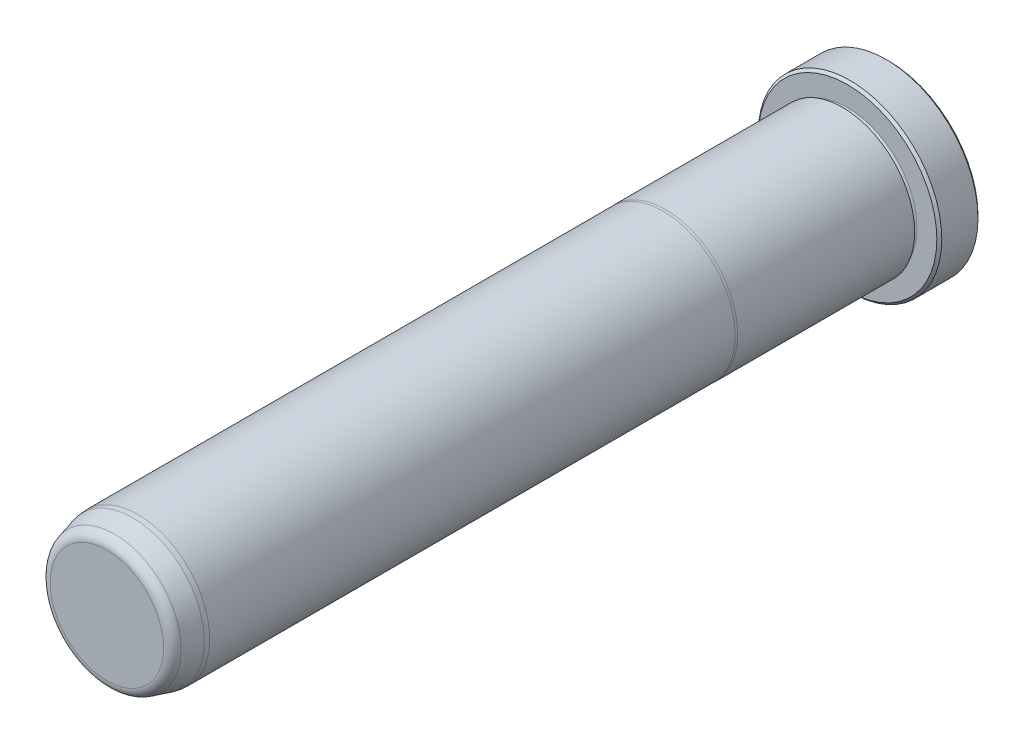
ISO-10303-21;
HEADER;
FILE_DESCRIPTION(('STEP AP214'),'2;1');
FILE_NAME('part.step','',(''),(''),'','','');
FILE_SCHEMA(('AUTOMOTIVE_DESIGN { 1 0 10303 214 1 1 1 1 }'));
ENDSEC;
DATA;
#1=APPLICATION_CONTEXT('core data for automotive mechanical design processes');
#2=APPLICATION_PROTOCOL_DEFINITION('international standard','automotive_design',2000,#1);
#3=PRODUCT_CONTEXT('',#1,'mechanical');
#4=PRODUCT('Part','Part','',(#3));
#5=PRODUCT_RELATED_PRODUCT_CATEGORY('part','',(#4));
#6=PRODUCT_DEFINITION_FORMATION('','',#4);
#7=PRODUCT_DEFINITION_CONTEXT('part definition',#1,'design');
#8=PRODUCT_DEFINITION('design','',#6,#7);
#9=PRODUCT_DEFINITION_SHAPE('','',#8);
#10=(LENGTH_UNIT() NAMED_UNIT(*) SI_UNIT(.MILLI.,.METRE.));
#11=(NAMED_UNIT(*) PLANE_ANGLE_UNIT() SI_UNIT($,.RADIAN.));
#12=(NAMED_UNIT(*) SI_UNIT($,.STERADIAN.) SOLID_ANGLE_UNIT());
#13=UNCERTAINTY_MEASURE_WITH_UNIT(LENGTH_MEASURE(1.E-05),#10,'distance_accuracy_value','');
#14=(GEOMETRIC_REPRESENTATION_CONTEXT(3) GLOBAL_UNCERTAINTY_ASSIGNED_CONTEXT((#13)) GLOBAL_UNIT_ASSIGNED_CONTEXT((#10,
#11,#12)) REPRESENTATION_CONTEXT('',''));
#15=CARTESIAN_POINT('',(0.,0.,0.));
#16=DIRECTION('',(0.,0.,1.));
#17=DIRECTION('',(1.,0.,0.));
#18=AXIS2_PLACEMENT_3D('',#15,#16,#17);
#19=CARTESIAN_POINT('',(0.,0.,0.));
#20=DIRECTION('',(0.,0.,1.));
#21=DIRECTION('',(1.,0.,0.));
#22=AXIS2_PLACEMENT_3D('',#19,#20,#21);
#23=PLANE('',#22);
#24=CARTESIAN_POINT('',(0.,0.,0.));
#25=DIRECTION('',(0.,0.,1.));
#26=DIRECTION('',(1.,0.,0.));
#27=AXIS2_PLACEMENT_3D('',#24,#25,#26);
#28=CIRCLE('',#27,13.7795);
#29=CARTESIAN_POINT('',(13.7795,0.,0.));
#30=VERTEX_POINT('',#29);
#31=EDGE_CURVE('E37',#30,#30,#28,.F.);
#32=ORIENTED_EDGE('',*,*,#31,.T.);
#33=EDGE_LOOP('',(#32));
#34=FACE_BOUND('',#33,.T.);
#35=ADVANCED_FACE('F30',(#34),#23,.F.);
#36=CARTESIAN_POINT('',(0.,0.,0.));
#37=DIRECTION('',(0.,0.,1.));
#38=DIRECTION('',(1.,0.,0.));
#39=AXIS2_PLACEMENT_3D('',#36,#37,#38);
#40=CYLINDRICAL_SURFACE('',#39,14.1605);
#41=CARTESIAN_POINT('',(0.,0.,0.380999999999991));
#42=DIRECTION('',(0.,0.,1.));
#43=DIRECTION('',(1.,0.,0.));
#44=AXIS2_PLACEMENT_3D('',#41,#42,#43);
#45=CIRCLE('',#44,14.1605);
#46=CARTESIAN_POINT('',(14.1605,0.,0.380999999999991));
#47=VERTEX_POINT('',#46);
#48=EDGE_CURVE('E41',#47,#47,#45,.T.);
#49=ORIENTED_EDGE('',*,*,#48,.T.);
#50=EDGE_LOOP('',(#49));
#51=FACE_BOUND('',#50,.T.);
#52=CARTESIAN_POINT('',(0.,0.,5.96900000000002));
#53=DIRECTION('',(0.,0.,-1.));
#54=DIRECTION('',(-1.,0.,0.));
#55=AXIS2_PLACEMENT_3D('',#52,#53,#54);
#56=CIRCLE('',#55,14.1605);
#57=CARTESIAN_POINT('',(-14.1605,0.,5.96900000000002));
#58=VERTEX_POINT('',#57);
#59=EDGE_CURVE('E45',#58,#58,#56,.T.);
#60=ORIENTED_EDGE('',*,*,#59,.T.);
#61=EDGE_LOOP('',(#60));
#62=FACE_BOUND('',#61,.T.);
#63=ADVANCED_FACE('F118',(#51,#62),#40,.T.);
#64=CARTESIAN_POINT('',(0.,14.1605,6.35));
#65=DIRECTION('',(0.,0.,-1.));
#66=DIRECTION('',(-1.,0.,0.));
#67=AXIS2_PLACEMENT_3D('',#64,#65,#66);
#68=PLANE('',#67);
#69=CARTESIAN_POINT('',(0.,0.,6.35));
#70=DIRECTION('',(0.,0.,-1.));
#71=DIRECTION('',(-1.,0.,0.));
#72=AXIS2_PLACEMENT_3D('',#69,#70,#71);
#73=CIRCLE('',#72,13.7795);
#74=CARTESIAN_POINT('',(-13.7795,0.,6.35));
#75=VERTEX_POINT('',#74);
#76=EDGE_CURVE('E10',#75,#75,#73,.F.);
#77=ORIENTED_EDGE('',*,*,#76,.T.);
#78=EDGE_LOOP('',(#77));
#79=FACE_BOUND('',#78,.T.);
#80=CARTESIAN_POINT('',(0.,0.,6.35));
#81=DIRECTION('',(0.,0.,1.));
#82=DIRECTION('',(1.,0.,0.));
#83=AXIS2_PLACEMENT_3D('',#80,#81,#82);
#84=CIRCLE('',#83,10.7188);
#85=CARTESIAN_POINT('',(10.7188,0.,6.35));
#86=VERTEX_POINT('',#85);
#87=EDGE_CURVE('E56',#86,#86,#84,.T.);
#88=ORIENTED_EDGE('',*,*,#87,.F.);
#89=EDGE_LOOP('',(#88));
#90=FACE_BOUND('',#89,.T.);
#91=ADVANCED_FACE('F113',(#79,#90),#68,.F.);
#92=CARTESIAN_POINT('',(0.,0.,6.731));
#93=DIRECTION('',(0.,0.,1.));
#94=DIRECTION('',(1.,0.,0.));
#95=AXIS2_PLACEMENT_3D('',#92,#93,#94);
#96=TOROIDAL_SURFACE('',#95,10.7188,0.381000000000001);
#97=CARTESIAN_POINT('',(0.,0.,7.112));
#98=DIRECTION('',(0.,0.,1.));
#99=DIRECTION('',(1.,0.,0.));
#100=AXIS2_PLACEMENT_3D('',#97,#98,#99);
#101=CIRCLE('',#100,10.7188);
#102=CARTESIAN_POINT('',(10.7188,0.,7.112));
#103=VERTEX_POINT('',#102);
#104=EDGE_CURVE('E59',#103,#103,#101,.T.);
#105=ORIENTED_EDGE('',*,*,#104,.F.);
#106=EDGE_LOOP('',(#105));
#107=FACE_BOUND('',#106,.T.);
#108=ORIENTED_EDGE('',*,*,#87,.T.);
#109=EDGE_LOOP('',(#108));
#110=FACE_BOUND('',#109,.T.);
#111=ADVANCED_FACE('F107',(#107,#110),#96,.F.);
#112=CARTESIAN_POINT('',(0.,10.7188,7.112));
#113=DIRECTION('',(0.,0.,1.));
#114=DIRECTION('',(1.,0.,0.));
#115=AXIS2_PLACEMENT_3D('',#112,#113,#114);
#116=PLANE('',#115);
#117=CARTESIAN_POINT('',(0.,0.,7.112));
#118=DIRECTION('',(0.,0.,1.));
#119=DIRECTION('',(1.,0.,0.));
#120=AXIS2_PLACEMENT_3D('',#117,#118,#119);
#121=CIRCLE('',#120,11.1252);
#122=CARTESIAN_POINT('',(11.1252,0.,7.112));
#123=VERTEX_POINT('',#122);
#124=EDGE_CURVE('E62',#123,#123,#121,.T.);
#125=ORIENTED_EDGE('',*,*,#124,.F.);
#126=EDGE_LOOP('',(#125));
#127=FACE_BOUND('',#126,.T.);
#128=ORIENTED_EDGE('',*,*,#104,.T.);
#129=EDGE_LOOP('',(#128));
#130=FACE_BOUND('',#129,.T.);
#131=ADVANCED_FACE('F101',(#127,#130),#116,.F.);
#132=CARTESIAN_POINT('',(0.,0.,0.));
#133=DIRECTION('',(0.,0.,1.));
#134=DIRECTION('',(1.,0.,0.));
#135=AXIS2_PLACEMENT_3D('',#132,#133,#134);
#136=CYLINDRICAL_SURFACE('',#135,11.1252);
#137=CARTESIAN_POINT('',(0.,0.,34.4347630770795));
#138=DIRECTION('',(0.,0.,1.));
#139=DIRECTION('',(1.,0.,0.));
#140=AXIS2_PLACEMENT_3D('',#137,#138,#139);
#141=CIRCLE('',#140,11.1252);
#142=CARTESIAN_POINT('',(11.1252,0.,34.4347630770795));
#143=VERTEX_POINT('',#142);
#144=EDGE_CURVE('E65',#143,#143,#141,.T.);
#145=ORIENTED_EDGE('',*,*,#144,.F.);
#146=EDGE_LOOP('',(#145));
#147=FACE_BOUND('',#146,.T.);
#148=ORIENTED_EDGE('',*,*,#124,.T.);
#149=EDGE_LOOP('',(#148));
#150=FACE_BOUND('',#149,.T.);
#151=ADVANCED_FACE('F95',(#147,#150),#136,.T.);
#152=CARTESIAN_POINT('',(0.,0.,34.4347630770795));
#153=DIRECTION('',(0.,0.,-1.));
#154=DIRECTION('',(-1.,0.,0.));
#155=AXIS2_PLACEMENT_3D('',#152,#153,#154);
#156=CONICAL_SURFACE('',#155,11.1252,0.0698131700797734);
#157=CARTESIAN_POINT('',(0.,0.,34.798));
#158=DIRECTION('',(0.,0.,1.));
#159=DIRECTION('',(1.,0.,0.));
#160=AXIS2_PLACEMENT_3D('',#157,#158,#159);
#161=CIRCLE('',#160,11.0998);
#162=CARTESIAN_POINT('',(11.0998,0.,34.798));
#163=VERTEX_POINT('',#162);
#164=EDGE_CURVE('E68',#163,#163,#161,.T.);
#165=ORIENTED_EDGE('',*,*,#164,.F.);
#166=EDGE_LOOP('',(#165));
#167=FACE_BOUND('',#166,.T.);
#168=ORIENTED_EDGE('',*,*,#144,.T.);
#169=EDGE_LOOP('',(#168));
#170=FACE_BOUND('',#169,.T.);
#171=ADVANCED_FACE('F89',(#167,#170),#156,.T.);
#172=CARTESIAN_POINT('',(0.,0.,0.));
#173=DIRECTION('',(0.,0.,1.));
#174=DIRECTION('',(1.,0.,0.));
#175=AXIS2_PLACEMENT_3D('',#172,#173,#174);
#176=CYLINDRICAL_SURFACE('',#175,11.0998);
#177=CARTESIAN_POINT('',(0.,0.,115.8875));
#178=DIRECTION('',(0.,0.,1.));
#179=DIRECTION('',(1.,0.,0.));
#180=AXIS2_PLACEMENT_3D('',#177,#178,#179);
#181=CIRCLE('',#180,11.0998);
#182=CARTESIAN_POINT('',(11.0998,0.,115.8875));
#183=VERTEX_POINT('',#182);
#184=EDGE_CURVE('E71',#183,#183,#181,.T.);
#185=ORIENTED_EDGE('',*,*,#184,.F.);
#186=EDGE_LOOP('',(#185));
#187=FACE_BOUND('',#186,.T.);
#188=ORIENTED_EDGE('',*,*,#164,.T.);
#189=EDGE_LOOP('',(#188));
#190=FACE_BOUND('',#189,.T.);
#191=ADVANCED_FACE('F83',(#187,#190),#176,.T.);
#192=CARTESIAN_POINT('',(0.,0.,115.8875));
#193=DIRECTION('',(0.,0.,-1.));
#194=DIRECTION('',(-1.,0.,0.));
#195=AXIS2_PLACEMENT_3D('',#192,#193,#194);
#196=CONICAL_SURFACE('',#195,11.0998,0.0872664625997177);
#197=CARTESIAN_POINT('',(0.,0.,116.6495));
#198=DIRECTION('',(0.,0.,1.));
#199=DIRECTION('',(1.,0.,0.));
#200=AXIS2_PLACEMENT_3D('',#197,#198,#199);
#201=CIRCLE('',#200,11.0331336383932);
#202=CARTESIAN_POINT('',(11.0331336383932,0.,116.6495));
#203=VERTEX_POINT('',#202);
#204=EDGE_CURVE('E74',#203,#203,#201,.T.);
#205=ORIENTED_EDGE('',*,*,#204,.F.);
#206=EDGE_LOOP('',(#205));
#207=FACE_BOUND('',#206,.T.);
#208=ORIENTED_EDGE('',*,*,#184,.T.);
#209=EDGE_LOOP('',(#208));
#210=FACE_BOUND('',#209,.T.);
#211=ADVANCED_FACE('F80',(#207,#210),#196,.T.);
#212=CARTESIAN_POINT('',(0.,0.,116.6495));
#213=DIRECTION('',(0.,0.,-1.));
#214=DIRECTION('',(-1.,0.,0.));
#215=AXIS2_PLACEMENT_3D('',#212,#213,#214);
#216=CONICAL_SURFACE('',#215,11.0331336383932,0.261799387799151);
#217=CARTESIAN_POINT('',(0.,0.,119.4733752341));
#218=DIRECTION('',(0.,0.,1.));
#219=DIRECTION('',(1.,0.,0.));
#220=AXIS2_PLACEMENT_3D('',#217,#218,#219);
#221=CIRCLE('',#220,10.2764785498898);
#222=CARTESIAN_POINT('',(10.2764785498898,0.,119.4733752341));
#223=VERTEX_POINT('',#222);
#224=EDGE_CURVE('E50',#223,#223,#221,.F.);
#225=ORIENTED_EDGE('',*,*,#224,.T.);
#226=EDGE_LOOP('',(#225));
#227=FACE_BOUND('',#226,.T.);
#228=ORIENTED_EDGE('',*,*,#204,.T.);
#229=EDGE_LOOP('',(#228));
#230=FACE_BOUND('',#229,.T.);
#231=ADVANCED_FACE('F78',(#227,#230),#216,.T.);
#232=CARTESIAN_POINT('',(0.,9.96120289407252,120.65));
#233=DIRECTION('',(0.,0.,-1.));
#234=DIRECTION('',(-1.,0.,0.));
#235=AXIS2_PLACEMENT_3D('',#232,#233,#234);
#236=PLANE('',#235);
#237=CARTESIAN_POINT('',(0.,0.,120.65));
#238=DIRECTION('',(0.,0.,-1.));
#239=DIRECTION('',(-1.,0.,0.));
#240=AXIS2_PLACEMENT_3D('',#237,#238,#239);
#241=CIRCLE('',#240,8.74307130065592);
#242=CARTESIAN_POINT('',(-8.74307130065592,0.,120.65));
#243=VERTEX_POINT('',#242);
#244=EDGE_CURVE('E53',#243,#243,#241,.F.);
#245=ORIENTED_EDGE('',*,*,#244,.T.);
#246=EDGE_LOOP('',(#245));
#247=FACE_BOUND('',#246,.T.);
#248=ADVANCED_FACE('F133',(#247),#236,.F.);
#249=CARTESIAN_POINT('',(0.,0.,119.0625));
#250=DIRECTION('',(0.,0.,-1.));
#251=DIRECTION('',(-1.,0.,0.));
#252=AXIS2_PLACEMENT_3D('',#249,#250,#251);
#253=TOROIDAL_SURFACE('',#252,8.74307130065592,1.5875);
#254=ORIENTED_EDGE('',*,*,#224,.F.);
#255=EDGE_LOOP('',(#254));
#256=FACE_BOUND('',#255,.T.);
#257=ORIENTED_EDGE('',*,*,#244,.F.);
#258=EDGE_LOOP('',(#257));
#259=FACE_BOUND('',#258,.T.);
#260=ADVANCED_FACE('F130',(#256,#259),#253,.T.);
#261=CARTESIAN_POINT('',(0.,0.,0.380999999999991));
#262=DIRECTION('',(0.,0.,1.));
#263=DIRECTION('',(1.,0.,0.));
#264=AXIS2_PLACEMENT_3D('',#261,#262,#263);
#265=CONICAL_SURFACE('',#264,14.1605,0.785398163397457);
#266=ORIENTED_EDGE('',*,*,#31,.F.);
#267=EDGE_LOOP('',(#266));
#268=FACE_BOUND('',#267,.T.);
#269=ORIENTED_EDGE('',*,*,#48,.F.);
#270=EDGE_LOOP('',(#269));
#271=FACE_BOUND('',#270,.T.);
#272=ADVANCED_FACE('F132',(#268,#271),#265,.T.);
#273=CARTESIAN_POINT('',(0.,0.,6.35));
#274=DIRECTION('',(0.,0.,-1.));
#275=DIRECTION('',(-1.,0.,0.));
#276=AXIS2_PLACEMENT_3D('',#273,#274,#275);
#277=CONICAL_SURFACE('',#276,13.7795,0.785398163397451);
#278=ORIENTED_EDGE('',*,*,#59,.F.);
#279=EDGE_LOOP('',(#278));
#280=FACE_BOUND('',#279,.T.);
#281=ORIENTED_EDGE('',*,*,#76,.F.);
#282=EDGE_LOOP('',(#281));
#283=FACE_BOUND('',#282,.T.);
#284=ADVANCED_FACE('F32',(#280,#283),#277,.T.);
#285=CLOSED_SHELL('',(#35,#63,#91,#111,#131,#151,#171,#191,#211,#231,#248,#260,#272,#284));
#286=MANIFOLD_SOLID_BREP('B2',#285);
#287=ADVANCED_BREP_SHAPE_REPRESENTATION('',(#18,#286),#14);
#288=SHAPE_DEFINITION_REPRESENTATION(#9,#287);
ENDSEC;
END-ISO-10303-21;
